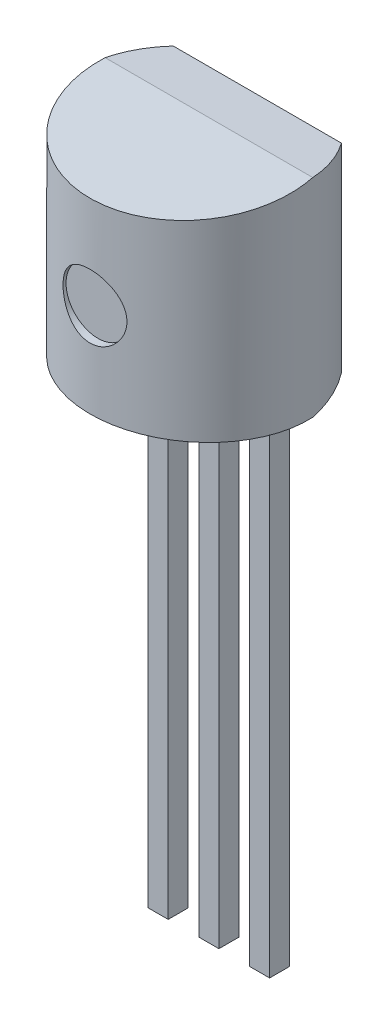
from build123d import *

# Parameters (mm, degrees)
BOSS_EXTRUDE1_DEPTH             = 2.6
SKETCH5_W                       = 11.826356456
SKETCH5_H                       = 5.621169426
CUT_EXTRUDE2_DEPTH              = 7.632050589
SKETCH6_W                       = 11.690711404
SKETCH6_H                       = 7.254613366
CUT_EXTRUDE3_DEPTH              = 5.2
SKETCH7_W                       = 0.5
SKETCH7_H                       = 0.5
BOSS_EXTRUDE2_DEPTH             = 12.7
BOSS_EXTRUDE2_DIRECTION_2_REACH = 8.542
SKETCH8_R                       = 0.8
CUT_EXTRUDE4_DEPTH              = 0.2


with BuildPart() as part:
    # Sketch2 → Boss-Extrude1 (new, symmetric)
    with BuildSketch(Plane(origin=(0, 0, 0), x_dir=(1, 0, 0), z_dir=(0, 1, 0))):
        with BuildLine():
            Line((-2.105447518, 1.212026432), (2.105447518, 1.212026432))
            ThreePointArc((2.105447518, 1.212026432), (0, -2.977973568), (-2.105447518, 1.212026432))
        make_face()
    extrude(amount=BOSS_EXTRUDE1_DEPTH, both=True)

    # Sketch5 → Cut-Extrude2 (cut, through all)
    with BuildSketch(Plane(origin=(0, 2.580250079, -0.225742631), x_dir=(1, 0, 0), z_dir=(0, 0.9961946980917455, -0.08715574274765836))):
        with Locations((0.924694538, -0.744658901)):
            Rectangle(SKETCH5_W, SKETCH5_H)
    cut_extrude2 = extrude(amount=CUT_EXTRUDE2_DEPTH, mode=Mode.SUBTRACT)

    # Sketch6 → Cut-Extrude3 (cut)
    with BuildSketch(Plane(origin=(0, 2.580250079, 0.225742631), x_dir=(1, 0, 0), z_dir=(0, 0.9961946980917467, 0.08715574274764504))):
        with Locations((0.257342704, -2.465539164)):
            Rectangle(SKETCH6_W, SKETCH6_H)
    cut_extrude3 = extrude(amount=CUT_EXTRUDE3_DEPTH, mode=Mode.SUBTRACT)

    # Mirror1: Cut-Extrude2, Cut-Extrude3 across plane
    add(cut_extrude2.mirror(Plane.ZX), mode=Mode.SUBTRACT)
    add(cut_extrude3.mirror(Plane.ZX), mode=Mode.SUBTRACT)

    # Sketch7 → Boss-Extrude2 (add)
    with BuildSketch(Plane(origin=(0, -2.6, 0), x_dir=(-1, 0, 0), z_dir=(0, -1, 0))):
        with Locations((-1.27, 0.25)):
            Rectangle(SKETCH7_W, SKETCH7_H)
        with Locations((0, 0.25)):
            Rectangle(SKETCH7_W, SKETCH7_H)
        with Locations((1.27, 0.25)):
            Rectangle(SKETCH7_W, SKETCH7_H)
    extrude(amount=BOSS_EXTRUDE2_DEPTH)

    # Sketch7 → Boss-Extrude2 direction 2 (add, up to next)
    with BuildSketch(Plane(origin=(0, -2.6, 0), x_dir=(-1, 0, 0), z_dir=(0, -1, 0)), mode=Mode.PRIVATE) as boss_extrude2_direction_2_sk1:
        with Locations((-1.27, 0.25)):
            Rectangle(SKETCH7_W, SKETCH7_H)
    boss_extrude2_direction_2_tool1 = extrude(boss_extrude2_direction_2_sk1.sketch, amount=-BOSS_EXTRUDE2_DIRECTION_2_REACH, mode=Mode.PRIVATE) - part.part
    # Sketch7 → Boss-Extrude2 direction 2 (add, up to next)
    with BuildSketch(Plane(origin=(0, -2.6, 0), x_dir=(-1, 0, 0), z_dir=(0, -1, 0)), mode=Mode.PRIVATE) as boss_extrude2_direction_2_sk2:
        with Locations((0, 0.25)):
            Rectangle(SKETCH7_W, SKETCH7_H)
    boss_extrude2_direction_2_tool2 = extrude(boss_extrude2_direction_2_sk2.sketch, amount=-BOSS_EXTRUDE2_DIRECTION_2_REACH, mode=Mode.PRIVATE) - part.part
    # Sketch7 → Boss-Extrude2 direction 2 (add, up to next)
    with BuildSketch(Plane(origin=(0, -2.6, 0), x_dir=(-1, 0, 0), z_dir=(0, -1, 0)), mode=Mode.PRIVATE) as boss_extrude2_direction_2_sk3:
        with Locations((1.27, 0.25)):
            Rectangle(SKETCH7_W, SKETCH7_H)
    boss_extrude2_direction_2_tool3 = extrude(boss_extrude2_direction_2_sk3.sketch, amount=-BOSS_EXTRUDE2_DIRECTION_2_REACH, mode=Mode.PRIVATE) - part.part
    add(boss_extrude2_direction_2_tool1.solids().sort_by_distance((1.27, -2.6, -0.25))[0])
    add(boss_extrude2_direction_2_tool2.solids().sort_by_distance((0, -2.6, -0.25))[0])
    add(boss_extrude2_direction_2_tool3.solids().sort_by_distance((-1.27, -2.6, -0.25))[0])

    # Sketch8 → Cut-Extrude4 (cut)
    with BuildSketch(Plane.XY.offset(2.977973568)):
        Circle(SKETCH8_R)
    extrude(amount=-CUT_EXTRUDE4_DEPTH, mode=Mode.SUBTRACT)


solid = part.part
